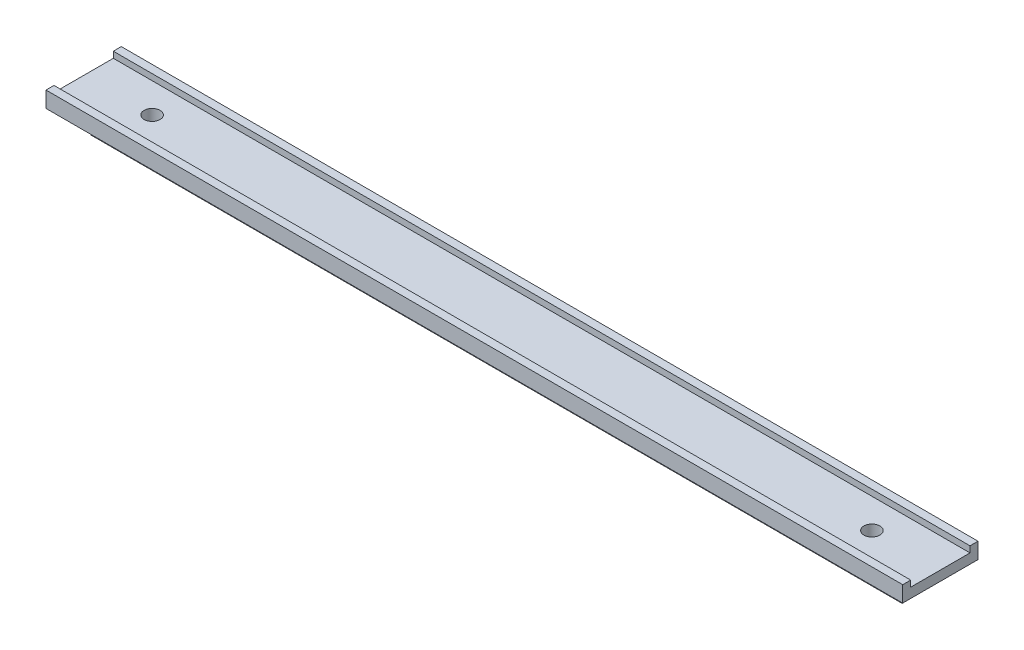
ISO-10303-21;
HEADER;
FILE_DESCRIPTION(('STEP AP214'),'2;1');
FILE_NAME('part.step','',(''),(''),'','','');
FILE_SCHEMA(('AUTOMOTIVE_DESIGN { 1 0 10303 214 1 1 1 1 }'));
ENDSEC;
DATA;
#1=APPLICATION_CONTEXT('core data for automotive mechanical design processes');
#2=APPLICATION_PROTOCOL_DEFINITION('international standard','automotive_design',2000,#1);
#3=PRODUCT_CONTEXT('',#1,'mechanical');
#4=PRODUCT('Part','Part','',(#3));
#5=PRODUCT_RELATED_PRODUCT_CATEGORY('part','',(#4));
#6=PRODUCT_DEFINITION_FORMATION('','',#4);
#7=PRODUCT_DEFINITION_CONTEXT('part definition',#1,'design');
#8=PRODUCT_DEFINITION('design','',#6,#7);
#9=PRODUCT_DEFINITION_SHAPE('','',#8);
#10=(LENGTH_UNIT() NAMED_UNIT(*) SI_UNIT(.MILLI.,.METRE.));
#11=(NAMED_UNIT(*) PLANE_ANGLE_UNIT() SI_UNIT($,.RADIAN.));
#12=(NAMED_UNIT(*) SI_UNIT($,.STERADIAN.) SOLID_ANGLE_UNIT());
#13=UNCERTAINTY_MEASURE_WITH_UNIT(LENGTH_MEASURE(1.E-05),#10,'distance_accuracy_value','');
#14=(GEOMETRIC_REPRESENTATION_CONTEXT(3) GLOBAL_UNCERTAINTY_ASSIGNED_CONTEXT((#13)) GLOBAL_UNIT_ASSIGNED_CONTEXT((#10,
#11,#12)) REPRESENTATION_CONTEXT('',''));
#15=CARTESIAN_POINT('',(0.,0.,0.));
#16=DIRECTION('',(0.,0.,1.));
#17=DIRECTION('',(1.,0.,0.));
#18=AXIS2_PLACEMENT_3D('',#15,#16,#17);
#19=CARTESIAN_POINT('',(187.75,5.86563908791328,-13.0312781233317));
#20=DIRECTION('',(0.,-1.,0.));
#21=DIRECTION('',(0.,0.,-1.));
#22=AXIS2_PLACEMENT_3D('',#19,#20,#21);
#23=PLANE('',#22);
#24=DIRECTION('',(0.,0.,1.));
#25=VECTOR('',#24,1.);
#26=CARTESIAN_POINT('',(-187.75,5.86563908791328,-13.0312781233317));
#27=LINE('',#26,#25);
#28=CARTESIAN_POINT('',(-187.75,5.86563908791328,-13.0312781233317));
#29=VERTEX_POINT('',#28);
#30=CARTESIAN_POINT('',(-187.75,5.86563908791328,12.9687218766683));
#31=VERTEX_POINT('',#30);
#32=EDGE_CURVE('E146',#29,#31,#27,.T.);
#33=ORIENTED_EDGE('',*,*,#32,.T.);
#34=DIRECTION('',(-1.,0.,0.));
#35=VECTOR('',#34,1.);
#36=CARTESIAN_POINT('',(187.75,5.86563908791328,12.9687218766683));
#37=LINE('',#36,#35);
#38=CARTESIAN_POINT('',(187.75,5.86563908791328,12.9687218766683));
#39=VERTEX_POINT('',#38);
#40=EDGE_CURVE('E196',#39,#31,#37,.T.);
#41=ORIENTED_EDGE('',*,*,#40,.F.);
#42=DIRECTION('',(0.,0.,1.));
#43=VECTOR('',#42,1.);
#44=CARTESIAN_POINT('',(187.75,5.86563908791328,-13.0312781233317));
#45=LINE('',#44,#43);
#46=CARTESIAN_POINT('',(187.75,5.86563908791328,-13.0312781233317));
#47=VERTEX_POINT('',#46);
#48=EDGE_CURVE('E184',#47,#39,#45,.T.);
#49=ORIENTED_EDGE('',*,*,#48,.F.);
#50=DIRECTION('',(-1.,0.,0.));
#51=VECTOR('',#50,1.);
#52=CARTESIAN_POINT('',(187.75,5.86563908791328,-13.0312781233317));
#53=LINE('',#52,#51);
#54=EDGE_CURVE('E191',#47,#29,#53,.T.);
#55=ORIENTED_EDGE('',*,*,#54,.T.);
#56=EDGE_LOOP('',(#33,#41,#49,#55));
#57=FACE_BOUND('',#56,.T.);
#58=CARTESIAN_POINT('',(-157.75,5.86563908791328,-0.0312782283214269));
#59=DIRECTION('',(0.,-1.,0.));
#60=DIRECTION('',(0.,0.,-1.));
#61=AXIS2_PLACEMENT_3D('',#58,#59,#60);
#62=CIRCLE('',#61,3.5);
#63=CARTESIAN_POINT('',(-157.75,5.86563908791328,-3.53127822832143));
#64=VERTEX_POINT('',#63);
#65=EDGE_CURVE('E299',#64,#64,#62,.F.);
#66=ORIENTED_EDGE('',*,*,#65,.F.);
#67=EDGE_LOOP('',(#66));
#68=FACE_BOUND('',#67,.T.);
#69=CARTESIAN_POINT('',(157.75,5.86563908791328,-0.0312782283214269));
#70=DIRECTION('',(0.,-1.,0.));
#71=DIRECTION('',(0.,0.,-1.));
#72=AXIS2_PLACEMENT_3D('',#69,#70,#71);
#73=CIRCLE('',#72,3.5);
#74=CARTESIAN_POINT('',(157.75,5.86563908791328,-3.53127822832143));
#75=VERTEX_POINT('',#74);
#76=EDGE_CURVE('E508',#75,#75,#73,.F.);
#77=ORIENTED_EDGE('',*,*,#76,.F.);
#78=EDGE_LOOP('',(#77));
#79=FACE_BOUND('',#78,.T.);
#80=ADVANCED_FACE('F96',(#57,#68,#79),#23,.F.);
#81=CARTESIAN_POINT('',(187.75,8.56563908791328,12.9687218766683));
#82=DIRECTION('',(0.,-1.,0.));
#83=DIRECTION('',(0.,0.,-1.));
#84=AXIS2_PLACEMENT_3D('',#81,#82,#83);
#85=PLANE('',#84);
#86=DIRECTION('',(0.,0.,1.));
#87=VECTOR('',#86,1.);
#88=CARTESIAN_POINT('',(-187.75,8.56563908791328,12.9687218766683));
#89=LINE('',#88,#87);
#90=CARTESIAN_POINT('',(-187.75,8.56563908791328,12.9687218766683));
#91=VERTEX_POINT('',#90);
#92=CARTESIAN_POINT('',(-187.75,8.56563908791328,16.4687218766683));
#93=VERTEX_POINT('',#92);
#94=EDGE_CURVE('E204',#91,#93,#89,.T.);
#95=ORIENTED_EDGE('',*,*,#94,.T.);
#96=DIRECTION('',(-1.,0.,0.));
#97=VECTOR('',#96,1.);
#98=CARTESIAN_POINT('',(187.75,8.56563908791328,16.4687218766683));
#99=LINE('',#98,#97);
#100=CARTESIAN_POINT('',(187.75,8.56563908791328,16.4687218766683));
#101=VERTEX_POINT('',#100);
#102=EDGE_CURVE('E13',#101,#93,#99,.T.);
#103=ORIENTED_EDGE('',*,*,#102,.F.);
#104=DIRECTION('',(0.,0.,1.));
#105=VECTOR('',#104,1.);
#106=CARTESIAN_POINT('',(187.75,8.56563908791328,12.9687218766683));
#107=LINE('',#106,#105);
#108=CARTESIAN_POINT('',(187.75,8.56563908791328,12.9687218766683));
#109=VERTEX_POINT('',#108);
#110=EDGE_CURVE('E222',#109,#101,#107,.T.);
#111=ORIENTED_EDGE('',*,*,#110,.F.);
#112=DIRECTION('',(-1.,0.,0.));
#113=VECTOR('',#112,1.);
#114=CARTESIAN_POINT('',(187.75,8.56563908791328,12.9687218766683));
#115=LINE('',#114,#113);
#116=EDGE_CURVE('E200',#109,#91,#115,.T.);
#117=ORIENTED_EDGE('',*,*,#116,.T.);
#118=EDGE_LOOP('',(#95,#103,#111,#117));
#119=FACE_BOUND('',#118,.T.);
#120=ADVANCED_FACE('F98',(#119),#85,.F.);
#121=CARTESIAN_POINT('',(187.75,8.56563908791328,16.4687218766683));
#122=DIRECTION('',(0.,0.,-1.));
#123=DIRECTION('',(-1.,0.,0.));
#124=AXIS2_PLACEMENT_3D('',#121,#122,#123);
#125=PLANE('',#124);
#126=DIRECTION('',(0.,-1.,0.));
#127=VECTOR('',#126,1.);
#128=CARTESIAN_POINT('',(-187.75,8.56563908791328,16.4687218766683));
#129=LINE('',#128,#127);
#130=CARTESIAN_POINT('',(-187.75,1.56563908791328,16.4687218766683));
#131=VERTEX_POINT('',#130);
#132=EDGE_CURVE('E207',#93,#131,#129,.T.);
#133=ORIENTED_EDGE('',*,*,#132,.T.);
#134=DIRECTION('',(-1.,0.,0.));
#135=VECTOR('',#134,1.);
#136=CARTESIAN_POINT('',(187.75,1.56563908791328,16.4687218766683));
#137=LINE('',#136,#135);
#138=CARTESIAN_POINT('',(187.75,1.56563908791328,16.4687218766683));
#139=VERTEX_POINT('',#138);
#140=EDGE_CURVE('E105',#139,#131,#137,.T.);
#141=ORIENTED_EDGE('',*,*,#140,.F.);
#142=DIRECTION('',(0.,-1.,0.));
#143=VECTOR('',#142,1.);
#144=CARTESIAN_POINT('',(187.75,8.56563908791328,16.4687218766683));
#145=LINE('',#144,#143);
#146=EDGE_CURVE('E160',#101,#139,#145,.T.);
#147=ORIENTED_EDGE('',*,*,#146,.F.);
#148=ORIENTED_EDGE('',*,*,#102,.T.);
#149=EDGE_LOOP('',(#133,#141,#147,#148));
#150=FACE_BOUND('',#149,.T.);
#151=ADVANCED_FACE('F353',(#150),#125,.F.);
#152=CARTESIAN_POINT('',(187.75,1.56563908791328,16.4687218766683));
#153=DIRECTION('',(0.,1.,0.));
#154=DIRECTION('',(0.,0.,1.));
#155=AXIS2_PLACEMENT_3D('',#152,#153,#154);
#156=PLANE('',#155);
#157=DIRECTION('',(0.,0.,-1.));
#158=VECTOR('',#157,1.);
#159=CARTESIAN_POINT('',(-187.75,1.56563908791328,16.4687218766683));
#160=LINE('',#159,#158);
#161=CARTESIAN_POINT('',(-187.75,1.56563908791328,3.96872182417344));
#162=VERTEX_POINT('',#161);
#163=EDGE_CURVE('E210',#131,#162,#160,.T.);
#164=ORIENTED_EDGE('',*,*,#163,.T.);
#165=DIRECTION('',(-1.,0.,0.));
#166=VECTOR('',#165,1.);
#167=CARTESIAN_POINT('',(187.75,1.56563908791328,3.96872182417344));
#168=LINE('',#167,#166);
#169=CARTESIAN_POINT('',(187.75,1.56563908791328,3.96872182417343));
#170=VERTEX_POINT('',#169);
#171=EDGE_CURVE('E253',#170,#162,#168,.T.);
#172=ORIENTED_EDGE('',*,*,#171,.F.);
#173=DIRECTION('',(0.,0.,-1.));
#174=VECTOR('',#173,1.);
#175=CARTESIAN_POINT('',(187.75,1.56563908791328,16.4687218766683));
#176=LINE('',#175,#174);
#177=EDGE_CURVE('E262',#139,#170,#176,.T.);
#178=ORIENTED_EDGE('',*,*,#177,.F.);
#179=ORIENTED_EDGE('',*,*,#140,.T.);
#180=EDGE_LOOP('',(#164,#172,#178,#179));
#181=FACE_BOUND('',#180,.T.);
#182=ADVANCED_FACE('F259',(#181),#156,.F.);
#183=CARTESIAN_POINT('',(187.75,1.56563908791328,3.96872182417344));
#184=DIRECTION('',(0.,0.,-1.));
#185=DIRECTION('',(-1.,0.,0.));
#186=AXIS2_PLACEMENT_3D('',#183,#184,#185);
#187=PLANE('',#186);
#188=ORIENTED_EDGE('',*,*,#171,.T.);
#189=DIRECTION('',(-0.707106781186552,0.707106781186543,0.));
#190=VECTOR('',#189,1.);
#191=CARTESIAN_POINT('',(-187.75,1.56563908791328,3.96872182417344));
#192=LINE('',#191,#190);
#193=CARTESIAN_POINT('',(-182.95,-3.23436091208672,3.96872182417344));
#194=VERTEX_POINT('',#193);
#195=EDGE_CURVE('E208',#194,#162,#192,.T.);
#196=ORIENTED_EDGE('',*,*,#195,.F.);
#197=DIRECTION('',(-1.,0.,0.));
#198=VECTOR('',#197,1.);
#199=CARTESIAN_POINT('',(187.75,-3.23436091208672,3.96872182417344));
#200=LINE('',#199,#198);
#201=CARTESIAN_POINT('',(182.95,-3.23436091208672,3.96872182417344));
#202=VERTEX_POINT('',#201);
#203=EDGE_CURVE('E250',#202,#194,#200,.T.);
#204=ORIENTED_EDGE('',*,*,#203,.F.);
#205=DIRECTION('',(-0.707106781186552,-0.707106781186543,0.));
#206=VECTOR('',#205,1.);
#207=CARTESIAN_POINT('',(187.75,1.56563908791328,3.96872182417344));
#208=LINE('',#207,#206);
#209=EDGE_CURVE('E302',#170,#202,#208,.T.);
#210=ORIENTED_EDGE('',*,*,#209,.F.);
#211=EDGE_LOOP('',(#188,#196,#204,#210));
#212=FACE_BOUND('',#211,.T.);
#213=ADVANCED_FACE('F385',(#212),#187,.F.);
#214=CARTESIAN_POINT('',(187.75,-3.23436091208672,3.96872182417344));
#215=DIRECTION('',(0.,-1.,0.));
#216=DIRECTION('',(0.,0.,-1.));
#217=AXIS2_PLACEMENT_3D('',#214,#215,#216);
#218=PLANE('',#217);
#219=ORIENTED_EDGE('',*,*,#203,.T.);
#220=DIRECTION('',(0.,0.,-1.));
#221=VECTOR('',#220,1.);
#222=CARTESIAN_POINT('',(-182.95,-3.23436091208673,-16.5322782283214));
#223=LINE('',#222,#221);
#224=CARTESIAN_POINT('',(-182.95,-3.23436091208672,6.71872182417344));
#225=VERTEX_POINT('',#224);
#226=EDGE_CURVE('E316',#225,#194,#223,.T.);
#227=ORIENTED_EDGE('',*,*,#226,.F.);
#228=DIRECTION('',(-1.,0.,0.));
#229=VECTOR('',#228,1.);
#230=CARTESIAN_POINT('',(187.75,-3.23436091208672,6.71872182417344));
#231=LINE('',#230,#229);
#232=CARTESIAN_POINT('',(182.95,-3.23436091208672,6.71872182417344));
#233=VERTEX_POINT('',#232);
#234=EDGE_CURVE('E247',#233,#225,#231,.T.);
#235=ORIENTED_EDGE('',*,*,#234,.F.);
#236=DIRECTION('',(0.,0.,1.));
#237=VECTOR('',#236,1.);
#238=CARTESIAN_POINT('',(182.95,-3.23436091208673,-16.5322782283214));
#239=LINE('',#238,#237);
#240=EDGE_CURVE('E313',#202,#233,#239,.T.);
#241=ORIENTED_EDGE('',*,*,#240,.F.);
#242=EDGE_LOOP('',(#219,#227,#235,#241));
#243=FACE_BOUND('',#242,.T.);
#244=ADVANCED_FACE('F381',(#243),#218,.F.);
#245=CARTESIAN_POINT('',(187.75,-3.23436091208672,6.71872182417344));
#246=DIRECTION('',(0.,0.,-1.));
#247=DIRECTION('',(-1.,0.,0.));
#248=AXIS2_PLACEMENT_3D('',#245,#246,#247);
#249=PLANE('',#248);
#250=ORIENTED_EDGE('',*,*,#234,.T.);
#251=DIRECTION('',(-0.707106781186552,0.707106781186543,0.));
#252=VECTOR('',#251,1.);
#253=CARTESIAN_POINT('',(-187.75,1.56563908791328,6.71872182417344));
#254=LINE('',#253,#252);
#255=CARTESIAN_POINT('',(-177.75,-8.43436091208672,6.71872182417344));
#256=VERTEX_POINT('',#255);
#257=EDGE_CURVE('E281',#256,#225,#254,.T.);
#258=ORIENTED_EDGE('',*,*,#257,.F.);
#259=DIRECTION('',(-1.,0.,0.));
#260=VECTOR('',#259,1.);
#261=CARTESIAN_POINT('',(187.75,-8.43436091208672,6.71872182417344));
#262=LINE('',#261,#260);
#263=CARTESIAN_POINT('',(177.75,-8.43436091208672,6.71872182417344));
#264=VERTEX_POINT('',#263);
#265=EDGE_CURVE('E244',#264,#256,#262,.T.);
#266=ORIENTED_EDGE('',*,*,#265,.F.);
#267=DIRECTION('',(-0.707106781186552,-0.707106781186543,0.));
#268=VECTOR('',#267,1.);
#269=CARTESIAN_POINT('',(187.75,1.56563908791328,6.71872182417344));
#270=LINE('',#269,#268);
#271=EDGE_CURVE('E295',#233,#264,#270,.T.);
#272=ORIENTED_EDGE('',*,*,#271,.F.);
#273=EDGE_LOOP('',(#250,#258,#266,#272));
#274=FACE_BOUND('',#273,.T.);
#275=ADVANCED_FACE('F377',(#274),#249,.F.);
#276=CARTESIAN_POINT('',(187.75,-8.43436091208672,6.71872182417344));
#277=DIRECTION('',(0.,1.,0.));
#278=DIRECTION('',(0.,0.,1.));
#279=AXIS2_PLACEMENT_3D('',#276,#277,#278);
#280=PLANE('',#279);
#281=CARTESIAN_POINT('',(157.75,-8.43436091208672,-0.0312782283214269));
#282=DIRECTION('',(0.,-1.,0.));
#283=DIRECTION('',(0.,0.,-1.));
#284=AXIS2_PLACEMENT_3D('',#281,#282,#283);
#285=CIRCLE('',#284,3.525);
#286=CARTESIAN_POINT('',(157.75,-8.43436091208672,-3.55627822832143));
#287=VERTEX_POINT('',#286);
#288=EDGE_CURVE('E506',#287,#287,#285,.T.);
#289=ORIENTED_EDGE('',*,*,#288,.F.);
#290=EDGE_LOOP('',(#289));
#291=FACE_BOUND('',#290,.T.);
#292=CARTESIAN_POINT('',(-157.75,-8.43436091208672,-0.0312782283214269));
#293=DIRECTION('',(0.,-1.,0.));
#294=DIRECTION('',(0.,0.,-1.));
#295=AXIS2_PLACEMENT_3D('',#292,#293,#294);
#296=CIRCLE('',#295,3.525);
#297=CARTESIAN_POINT('',(-157.75,-8.43436091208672,-3.55627822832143));
#298=VERTEX_POINT('',#297);
#299=EDGE_CURVE('E515',#298,#298,#296,.T.);
#300=ORIENTED_EDGE('',*,*,#299,.F.);
#301=EDGE_LOOP('',(#300));
#302=FACE_BOUND('',#301,.T.);
#303=ORIENTED_EDGE('',*,*,#265,.T.);
#304=DIRECTION('',(0.,0.,1.));
#305=VECTOR('',#304,1.);
#306=CARTESIAN_POINT('',(-177.75,-8.43436091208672,-16.5322782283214));
#307=LINE('',#306,#305);
#308=CARTESIAN_POINT('',(-177.75,-8.43436091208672,-6.78127817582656));
#309=VERTEX_POINT('',#308);
#310=EDGE_CURVE('E276',#309,#256,#307,.T.);
#311=ORIENTED_EDGE('',*,*,#310,.F.);
#312=DIRECTION('',(-1.,0.,0.));
#313=VECTOR('',#312,1.);
#314=CARTESIAN_POINT('',(187.75,-8.43436091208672,-6.78127817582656));
#315=LINE('',#314,#313);
#316=CARTESIAN_POINT('',(177.75,-8.43436091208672,-6.78127817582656));
#317=VERTEX_POINT('',#316);
#318=EDGE_CURVE('E241',#317,#309,#315,.T.);
#319=ORIENTED_EDGE('',*,*,#318,.F.);
#320=DIRECTION('',(0.,0.,1.));
#321=VECTOR('',#320,1.);
#322=CARTESIAN_POINT('',(177.75,-8.43436091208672,-16.5322782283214));
#323=LINE('',#322,#321);
#324=EDGE_CURVE('E296',#317,#264,#323,.T.);
#325=ORIENTED_EDGE('',*,*,#324,.T.);
#326=EDGE_LOOP('',(#303,#311,#319,#325));
#327=FACE_BOUND('',#326,.T.);
#328=ADVANCED_FACE('F374',(#291,#302,#327),#280,.F.);
#329=CARTESIAN_POINT('',(187.75,-8.43436091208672,-6.78127817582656));
#330=DIRECTION('',(0.,0.,1.));
#331=DIRECTION('',(1.,0.,0.));
#332=AXIS2_PLACEMENT_3D('',#329,#330,#331);
#333=PLANE('',#332);
#334=ORIENTED_EDGE('',*,*,#318,.T.);
#335=DIRECTION('',(0.707106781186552,-0.707106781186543,0.));
#336=VECTOR('',#335,1.);
#337=CARTESIAN_POINT('',(-187.75,1.56563908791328,-6.78127817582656));
#338=LINE('',#337,#336);
#339=CARTESIAN_POINT('',(-182.95,-3.23436091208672,-6.78127817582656));
#340=VERTEX_POINT('',#339);
#341=EDGE_CURVE('E288',#340,#309,#338,.T.);
#342=ORIENTED_EDGE('',*,*,#341,.F.);
#343=DIRECTION('',(-1.,0.,0.));
#344=VECTOR('',#343,1.);
#345=CARTESIAN_POINT('',(187.75,-3.23436091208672,-6.78127817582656));
#346=LINE('',#345,#344);
#347=CARTESIAN_POINT('',(182.95,-3.23436091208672,-6.78127817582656));
#348=VERTEX_POINT('',#347);
#349=EDGE_CURVE('E238',#348,#340,#346,.T.);
#350=ORIENTED_EDGE('',*,*,#349,.F.);
#351=DIRECTION('',(0.707106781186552,0.707106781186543,0.));
#352=VECTOR('',#351,1.);
#353=CARTESIAN_POINT('',(187.75,1.56563908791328,-6.78127817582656));
#354=LINE('',#353,#352);
#355=EDGE_CURVE('E305',#317,#348,#354,.T.);
#356=ORIENTED_EDGE('',*,*,#355,.F.);
#357=EDGE_LOOP('',(#334,#342,#350,#356));
#358=FACE_BOUND('',#357,.T.);
#359=ADVANCED_FACE('F370',(#358),#333,.F.);
#360=CARTESIAN_POINT('',(187.75,-3.23436091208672,-6.78127817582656));
#361=DIRECTION('',(0.,-1.,0.));
#362=DIRECTION('',(0.,0.,-1.));
#363=AXIS2_PLACEMENT_3D('',#360,#361,#362);
#364=PLANE('',#363);
#365=ORIENTED_EDGE('',*,*,#349,.T.);
#366=DIRECTION('',(0.,0.,-1.));
#367=VECTOR('',#366,1.);
#368=CARTESIAN_POINT('',(-182.95,-3.23436091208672,-16.5322782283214));
#369=LINE('',#368,#367);
#370=CARTESIAN_POINT('',(-182.95,-3.23436091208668,-4.03127817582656));
#371=VERTEX_POINT('',#370);
#372=EDGE_CURVE('E278',#371,#340,#369,.T.);
#373=ORIENTED_EDGE('',*,*,#372,.F.);
#374=DIRECTION('',(-1.,0.,0.));
#375=VECTOR('',#374,1.);
#376=CARTESIAN_POINT('',(187.75,-3.23436091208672,-4.03127817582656));
#377=LINE('',#376,#375);
#378=CARTESIAN_POINT('',(182.95,-3.23436091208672,-4.03127817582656));
#379=VERTEX_POINT('',#378);
#380=EDGE_CURVE('E235',#379,#371,#377,.T.);
#381=ORIENTED_EDGE('',*,*,#380,.F.);
#382=DIRECTION('',(0.,0.,1.));
#383=VECTOR('',#382,1.);
#384=CARTESIAN_POINT('',(182.95,-3.23436091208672,-16.5322782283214));
#385=LINE('',#384,#383);
#386=EDGE_CURVE('E308',#348,#379,#385,.T.);
#387=ORIENTED_EDGE('',*,*,#386,.F.);
#388=EDGE_LOOP('',(#365,#373,#381,#387));
#389=FACE_BOUND('',#388,.T.);
#390=ADVANCED_FACE('F366',(#389),#364,.F.);
#391=CARTESIAN_POINT('',(187.75,-3.23436091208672,-4.03127817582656));
#392=DIRECTION('',(0.,0.,1.));
#393=DIRECTION('',(1.,0.,0.));
#394=AXIS2_PLACEMENT_3D('',#391,#392,#393);
#395=PLANE('',#394);
#396=ORIENTED_EDGE('',*,*,#380,.T.);
#397=DIRECTION('',(0.707106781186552,-0.707106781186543,0.));
#398=VECTOR('',#397,1.);
#399=CARTESIAN_POINT('',(-187.75,1.56563908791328,-4.03127817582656));
#400=LINE('',#399,#398);
#401=CARTESIAN_POINT('',(-187.75,1.56563908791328,-4.03127817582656));
#402=VERTEX_POINT('',#401);
#403=EDGE_CURVE('E275',#402,#371,#400,.T.);
#404=ORIENTED_EDGE('',*,*,#403,.F.);
#405=DIRECTION('',(-1.,0.,0.));
#406=VECTOR('',#405,1.);
#407=CARTESIAN_POINT('',(187.75,1.56563908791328,-4.03127817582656));
#408=LINE('',#407,#406);
#409=CARTESIAN_POINT('',(187.75,1.56563908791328,-4.03127817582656));
#410=VERTEX_POINT('',#409);
#411=EDGE_CURVE('E232',#410,#402,#408,.T.);
#412=ORIENTED_EDGE('',*,*,#411,.F.);
#413=DIRECTION('',(0.707106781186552,0.707106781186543,0.));
#414=VECTOR('',#413,1.);
#415=CARTESIAN_POINT('',(187.75,1.56563908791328,-4.03127817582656));
#416=LINE('',#415,#414);
#417=EDGE_CURVE('E311',#379,#410,#416,.T.);
#418=ORIENTED_EDGE('',*,*,#417,.F.);
#419=EDGE_LOOP('',(#396,#404,#412,#418));
#420=FACE_BOUND('',#419,.T.);
#421=ADVANCED_FACE('F362',(#420),#395,.F.);
#422=CARTESIAN_POINT('',(187.75,1.56563908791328,-4.03127817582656));
#423=DIRECTION('',(0.,1.,0.));
#424=DIRECTION('',(0.,0.,1.));
#425=AXIS2_PLACEMENT_3D('',#422,#423,#424);
#426=PLANE('',#425);
#427=DIRECTION('',(0.,0.,-1.));
#428=VECTOR('',#427,1.);
#429=CARTESIAN_POINT('',(-187.75,1.56563908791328,-4.03127817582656));
#430=LINE('',#429,#428);
#431=CARTESIAN_POINT('',(-187.75,1.56563908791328,-16.5312782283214));
#432=VERTEX_POINT('',#431);
#433=EDGE_CURVE('E213',#402,#432,#430,.T.);
#434=ORIENTED_EDGE('',*,*,#433,.T.);
#435=DIRECTION('',(-1.,0.,0.));
#436=VECTOR('',#435,1.);
#437=CARTESIAN_POINT('',(187.75,1.56563908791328,-16.5312782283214));
#438=LINE('',#437,#436);
#439=CARTESIAN_POINT('',(187.75,1.56563908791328,-16.5312782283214));
#440=VERTEX_POINT('',#439);
#441=EDGE_CURVE('E229',#440,#432,#438,.T.);
#442=ORIENTED_EDGE('',*,*,#441,.F.);
#443=DIRECTION('',(0.,0.,-1.));
#444=VECTOR('',#443,1.);
#445=CARTESIAN_POINT('',(187.75,1.56563908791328,-4.03127817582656));
#446=LINE('',#445,#444);
#447=EDGE_CURVE('E320',#410,#440,#446,.T.);
#448=ORIENTED_EDGE('',*,*,#447,.F.);
#449=ORIENTED_EDGE('',*,*,#411,.T.);
#450=EDGE_LOOP('',(#434,#442,#448,#449));
#451=FACE_BOUND('',#450,.T.);
#452=ADVANCED_FACE('F359',(#451),#426,.F.);
#453=CARTESIAN_POINT('',(187.75,1.56563908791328,-16.5312782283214));
#454=DIRECTION('',(0.,-1.49985336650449E-08,1.));
#455=DIRECTION('',(0.,-1.,-1.49985336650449E-08));
#456=AXIS2_PLACEMENT_3D('',#453,#454,#455);
#457=PLANE('',#456);
#458=DIRECTION('',(0.,1.,1.49985336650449E-08));
#459=VECTOR('',#458,1.);
#460=CARTESIAN_POINT('',(-187.75,1.56563908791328,-16.5312782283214));
#461=LINE('',#460,#459);
#462=CARTESIAN_POINT('',(-187.75,8.56563908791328,-16.5312781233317));
#463=VERTEX_POINT('',#462);
#464=EDGE_CURVE('E215',#432,#463,#461,.T.);
#465=ORIENTED_EDGE('',*,*,#464,.T.);
#466=DIRECTION('',(-1.,0.,0.));
#467=VECTOR('',#466,1.);
#468=CARTESIAN_POINT('',(187.75,8.56563908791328,-16.5312781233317));
#469=LINE('',#468,#467);
#470=CARTESIAN_POINT('',(187.75,8.56563908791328,-16.5312781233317));
#471=VERTEX_POINT('',#470);
#472=EDGE_CURVE('E226',#471,#463,#469,.T.);
#473=ORIENTED_EDGE('',*,*,#472,.F.);
#474=DIRECTION('',(0.,1.,1.49985336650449E-08));
#475=VECTOR('',#474,1.);
#476=CARTESIAN_POINT('',(187.75,1.56563908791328,-16.5312782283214));
#477=LINE('',#476,#475);
#478=EDGE_CURVE('E322',#440,#471,#477,.T.);
#479=ORIENTED_EDGE('',*,*,#478,.F.);
#480=ORIENTED_EDGE('',*,*,#441,.T.);
#481=EDGE_LOOP('',(#465,#473,#479,#480));
#482=FACE_BOUND('',#481,.T.);
#483=ADVANCED_FACE('F328',(#482),#457,.F.);
#484=CARTESIAN_POINT('',(187.75,8.56563908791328,-16.5312781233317));
#485=DIRECTION('',(0.,-1.,0.));
#486=DIRECTION('',(0.,0.,-1.));
#487=AXIS2_PLACEMENT_3D('',#484,#485,#486);
#488=PLANE('',#487);
#489=DIRECTION('',(0.,0.,1.));
#490=VECTOR('',#489,1.);
#491=CARTESIAN_POINT('',(-187.75,8.56563908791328,-16.5312781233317));
#492=LINE('',#491,#490);
#493=CARTESIAN_POINT('',(-187.75,8.56563908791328,-13.0312781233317));
#494=VERTEX_POINT('',#493);
#495=EDGE_CURVE('E217',#463,#494,#492,.T.);
#496=ORIENTED_EDGE('',*,*,#495,.T.);
#497=DIRECTION('',(-1.,0.,0.));
#498=VECTOR('',#497,1.);
#499=CARTESIAN_POINT('',(187.75,8.56563908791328,-13.0312781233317));
#500=LINE('',#499,#498);
#501=CARTESIAN_POINT('',(187.75,8.56563908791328,-13.0312781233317));
#502=VERTEX_POINT('',#501);
#503=EDGE_CURVE('E195',#502,#494,#500,.T.);
#504=ORIENTED_EDGE('',*,*,#503,.F.);
#505=DIRECTION('',(0.,0.,1.));
#506=VECTOR('',#505,1.);
#507=CARTESIAN_POINT('',(187.75,8.56563908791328,-16.5312781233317));
#508=LINE('',#507,#506);
#509=EDGE_CURVE('E186',#471,#502,#508,.T.);
#510=ORIENTED_EDGE('',*,*,#509,.F.);
#511=ORIENTED_EDGE('',*,*,#472,.T.);
#512=EDGE_LOOP('',(#496,#504,#510,#511));
#513=FACE_BOUND('',#512,.T.);
#514=ADVANCED_FACE('F331',(#513),#488,.F.);
#515=CARTESIAN_POINT('',(187.75,8.56563908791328,-13.0312781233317));
#516=DIRECTION('',(0.,0.,-1.));
#517=DIRECTION('',(-1.,0.,0.));
#518=AXIS2_PLACEMENT_3D('',#515,#516,#517);
#519=PLANE('',#518);
#520=DIRECTION('',(0.,-1.,0.));
#521=VECTOR('',#520,1.);
#522=CARTESIAN_POINT('',(-187.75,8.56563908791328,-13.0312781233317));
#523=LINE('',#522,#521);
#524=EDGE_CURVE('E194',#494,#29,#523,.T.);
#525=ORIENTED_EDGE('',*,*,#524,.T.);
#526=ORIENTED_EDGE('',*,*,#54,.F.);
#527=DIRECTION('',(0.,-1.,0.));
#528=VECTOR('',#527,1.);
#529=CARTESIAN_POINT('',(187.75,8.56563908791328,-13.0312781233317));
#530=LINE('',#529,#528);
#531=EDGE_CURVE('E179',#502,#47,#530,.T.);
#532=ORIENTED_EDGE('',*,*,#531,.F.);
#533=ORIENTED_EDGE('',*,*,#503,.T.);
#534=EDGE_LOOP('',(#525,#526,#532,#533));
#535=FACE_BOUND('',#534,.T.);
#536=ADVANCED_FACE('F192',(#535),#519,.F.);
#537=CARTESIAN_POINT('',(187.75,5.86563908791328,12.9687218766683));
#538=DIRECTION('',(0.,0.,1.));
#539=DIRECTION('',(1.,0.,0.));
#540=AXIS2_PLACEMENT_3D('',#537,#538,#539);
#541=PLANE('',#540);
#542=DIRECTION('',(0.,1.,0.));
#543=VECTOR('',#542,1.);
#544=CARTESIAN_POINT('',(-187.75,5.86563908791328,12.9687218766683));
#545=LINE('',#544,#543);
#546=EDGE_CURVE('E152',#31,#91,#545,.T.);
#547=ORIENTED_EDGE('',*,*,#546,.T.);
#548=ORIENTED_EDGE('',*,*,#116,.F.);
#549=DIRECTION('',(0.,1.,0.));
#550=VECTOR('',#549,1.);
#551=CARTESIAN_POINT('',(187.75,5.86563908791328,12.9687218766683));
#552=LINE('',#551,#550);
#553=EDGE_CURVE('E113',#39,#109,#552,.T.);
#554=ORIENTED_EDGE('',*,*,#553,.F.);
#555=ORIENTED_EDGE('',*,*,#40,.T.);
#556=EDGE_LOOP('',(#547,#548,#554,#555));
#557=FACE_BOUND('',#556,.T.);
#558=ADVANCED_FACE('F335',(#557),#541,.F.);
#559=CARTESIAN_POINT('',(187.75,0.,0.));
#560=DIRECTION('',(1.,0.,0.));
#561=DIRECTION('',(0.,0.,-1.));
#562=AXIS2_PLACEMENT_3D('',#559,#560,#561);
#563=PLANE('',#562);
#564=DIRECTION('',(0.,0.,1.));
#565=VECTOR('',#564,1.);
#566=CARTESIAN_POINT('',(187.75,1.56563908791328,-16.5322782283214));
#567=LINE('',#566,#565);
#568=EDGE_CURVE('E292',#410,#170,#567,.T.);
#569=ORIENTED_EDGE('',*,*,#568,.F.);
#570=ORIENTED_EDGE('',*,*,#447,.T.);
#571=ORIENTED_EDGE('',*,*,#478,.T.);
#572=ORIENTED_EDGE('',*,*,#509,.T.);
#573=ORIENTED_EDGE('',*,*,#531,.T.);
#574=ORIENTED_EDGE('',*,*,#48,.T.);
#575=ORIENTED_EDGE('',*,*,#553,.T.);
#576=ORIENTED_EDGE('',*,*,#110,.T.);
#577=ORIENTED_EDGE('',*,*,#146,.T.);
#578=ORIENTED_EDGE('',*,*,#177,.T.);
#579=EDGE_LOOP('',(#569,#570,#571,#572,#573,#574,#575,#576,#577,#578));
#580=FACE_BOUND('',#579,.T.);
#581=ADVANCED_FACE('F182',(#580),#563,.T.);
#582=CARTESIAN_POINT('',(-187.75,0.,0.));
#583=DIRECTION('',(1.,0.,0.));
#584=DIRECTION('',(0.,0.,-1.));
#585=AXIS2_PLACEMENT_3D('',#582,#583,#584);
#586=PLANE('',#585);
#587=ORIENTED_EDGE('',*,*,#433,.F.);
#588=DIRECTION('',(0.,0.,1.));
#589=VECTOR('',#588,1.);
#590=CARTESIAN_POINT('',(-187.75,1.56563908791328,-16.5322782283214));
#591=LINE('',#590,#589);
#592=EDGE_CURVE('E269',#402,#162,#591,.T.);
#593=ORIENTED_EDGE('',*,*,#592,.T.);
#594=ORIENTED_EDGE('',*,*,#163,.F.);
#595=ORIENTED_EDGE('',*,*,#132,.F.);
#596=ORIENTED_EDGE('',*,*,#94,.F.);
#597=ORIENTED_EDGE('',*,*,#546,.F.);
#598=ORIENTED_EDGE('',*,*,#32,.F.);
#599=ORIENTED_EDGE('',*,*,#524,.F.);
#600=ORIENTED_EDGE('',*,*,#495,.F.);
#601=ORIENTED_EDGE('',*,*,#464,.F.);
#602=EDGE_LOOP('',(#587,#593,#594,#595,#596,#597,#598,#599,#600,#601));
#603=FACE_BOUND('',#602,.T.);
#604=ADVANCED_FACE('F266',(#603),#586,.F.);
#605=CARTESIAN_POINT('',(-187.75,1.56563908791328,-16.5322782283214));
#606=DIRECTION('',(0.707106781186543,0.707106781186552,0.));
#607=DIRECTION('',(-0.707106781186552,0.707106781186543,0.));
#608=AXIS2_PLACEMENT_3D('',#605,#606,#607);
#609=PLANE('',#608);
#610=ORIENTED_EDGE('',*,*,#195,.T.);
#611=ORIENTED_EDGE('',*,*,#592,.F.);
#612=ORIENTED_EDGE('',*,*,#403,.T.);
#613=ORIENTED_EDGE('',*,*,#372,.T.);
#614=ORIENTED_EDGE('',*,*,#341,.T.);
#615=ORIENTED_EDGE('',*,*,#310,.T.);
#616=ORIENTED_EDGE('',*,*,#257,.T.);
#617=ORIENTED_EDGE('',*,*,#226,.T.);
#618=EDGE_LOOP('',(#610,#611,#612,#613,#614,#615,#616,#617));
#619=FACE_BOUND('',#618,.T.);
#620=ADVANCED_FACE('F435',(#619),#609,.F.);
#621=CARTESIAN_POINT('',(187.75,1.56563908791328,-16.5322782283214));
#622=DIRECTION('',(-0.707106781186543,0.707106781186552,0.));
#623=DIRECTION('',(-0.707106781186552,-0.707106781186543,0.));
#624=AXIS2_PLACEMENT_3D('',#621,#622,#623);
#625=PLANE('',#624);
#626=ORIENTED_EDGE('',*,*,#209,.T.);
#627=ORIENTED_EDGE('',*,*,#240,.T.);
#628=ORIENTED_EDGE('',*,*,#271,.T.);
#629=ORIENTED_EDGE('',*,*,#324,.F.);
#630=ORIENTED_EDGE('',*,*,#355,.T.);
#631=ORIENTED_EDGE('',*,*,#386,.T.);
#632=ORIENTED_EDGE('',*,*,#417,.T.);
#633=ORIENTED_EDGE('',*,*,#568,.T.);
#634=EDGE_LOOP('',(#626,#627,#628,#629,#630,#631,#632,#633));
#635=FACE_BOUND('',#634,.T.);
#636=ADVANCED_FACE('F444',(#635),#625,.F.);
#637=CARTESIAN_POINT('',(-157.75,-8.43436091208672,-0.0312782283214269));
#638=DIRECTION('',(0.,-1.,0.));
#639=DIRECTION('',(0.,0.,-1.));
#640=AXIS2_PLACEMENT_3D('',#637,#638,#639);
#641=CYLINDRICAL_SURFACE('',#640,3.5);
#642=ORIENTED_EDGE('',*,*,#65,.T.);
#643=EDGE_LOOP('',(#642));
#644=FACE_BOUND('',#643,.T.);
#645=CARTESIAN_POINT('',(-157.75,-8.40936091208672,-0.0312782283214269));
#646=DIRECTION('',(0.,-1.,0.));
#647=DIRECTION('',(0.,0.,-1.));
#648=AXIS2_PLACEMENT_3D('',#645,#646,#647);
#649=CIRCLE('',#648,3.5);
#650=CARTESIAN_POINT('',(-157.75,-8.40936091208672,-3.53127822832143));
#651=VERTEX_POINT('',#650);
#652=EDGE_CURVE('E514',#651,#651,#649,.T.);
#653=ORIENTED_EDGE('',*,*,#652,.T.);
#654=EDGE_LOOP('',(#653));
#655=FACE_BOUND('',#654,.T.);
#656=ADVANCED_FACE('F451',(#644,#655),#641,.F.);
#657=CARTESIAN_POINT('',(-157.75,-8.43436091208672,-0.0312782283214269));
#658=DIRECTION('',(0.,-1.,0.));
#659=DIRECTION('',(0.,0.,-1.));
#660=AXIS2_PLACEMENT_3D('',#657,#658,#659);
#661=CONICAL_SURFACE('',#660,3.525,0.785398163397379);
#662=ORIENTED_EDGE('',*,*,#652,.F.);
#663=EDGE_LOOP('',(#662));
#664=FACE_BOUND('',#663,.T.);
#665=ORIENTED_EDGE('',*,*,#299,.T.);
#666=EDGE_LOOP('',(#665));
#667=FACE_BOUND('',#666,.T.);
#668=ADVANCED_FACE('F467',(#664,#667),#661,.F.);
#669=CARTESIAN_POINT('',(157.75,-8.43436091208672,-0.0312782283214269));
#670=DIRECTION('',(0.,-1.,0.));
#671=DIRECTION('',(0.,0.,-1.));
#672=AXIS2_PLACEMENT_3D('',#669,#670,#671);
#673=CYLINDRICAL_SURFACE('',#672,3.5);
#674=ORIENTED_EDGE('',*,*,#76,.T.);
#675=EDGE_LOOP('',(#674));
#676=FACE_BOUND('',#675,.T.);
#677=CARTESIAN_POINT('',(157.75,-8.40936091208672,-0.0312782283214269));
#678=DIRECTION('',(0.,-1.,0.));
#679=DIRECTION('',(0.,0.,-1.));
#680=AXIS2_PLACEMENT_3D('',#677,#678,#679);
#681=CIRCLE('',#680,3.5);
#682=CARTESIAN_POINT('',(157.75,-8.40936091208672,-3.53127822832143));
#683=VERTEX_POINT('',#682);
#684=EDGE_CURVE('E503',#683,#683,#681,.T.);
#685=ORIENTED_EDGE('',*,*,#684,.T.);
#686=EDGE_LOOP('',(#685));
#687=FACE_BOUND('',#686,.T.);
#688=ADVANCED_FACE('F477',(#676,#687),#673,.F.);
#689=CARTESIAN_POINT('',(157.75,-8.43436091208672,-0.0312782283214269));
#690=DIRECTION('',(0.,-1.,0.));
#691=DIRECTION('',(0.,0.,-1.));
#692=AXIS2_PLACEMENT_3D('',#689,#690,#691);
#693=CONICAL_SURFACE('',#692,3.525,0.785398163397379);
#694=ORIENTED_EDGE('',*,*,#684,.F.);
#695=EDGE_LOOP('',(#694));
#696=FACE_BOUND('',#695,.T.);
#697=ORIENTED_EDGE('',*,*,#288,.T.);
#698=EDGE_LOOP('',(#697));
#699=FACE_BOUND('',#698,.T.);
#700=ADVANCED_FACE('F487',(#696,#699),#693,.F.);
#701=CLOSED_SHELL('',(#80,#120,#151,#182,#213,#244,#275,#328,#359,#390,#421,#452,#483,#514,#536,
#558,#581,#604,#620,#636,#656,#668,#688,#700));
#702=MANIFOLD_SOLID_BREP('B2',#701);
#703=ADVANCED_BREP_SHAPE_REPRESENTATION('',(#18,#702),#14);
#704=SHAPE_DEFINITION_REPRESENTATION(#9,#703);
ENDSEC;
END-ISO-10303-21;
